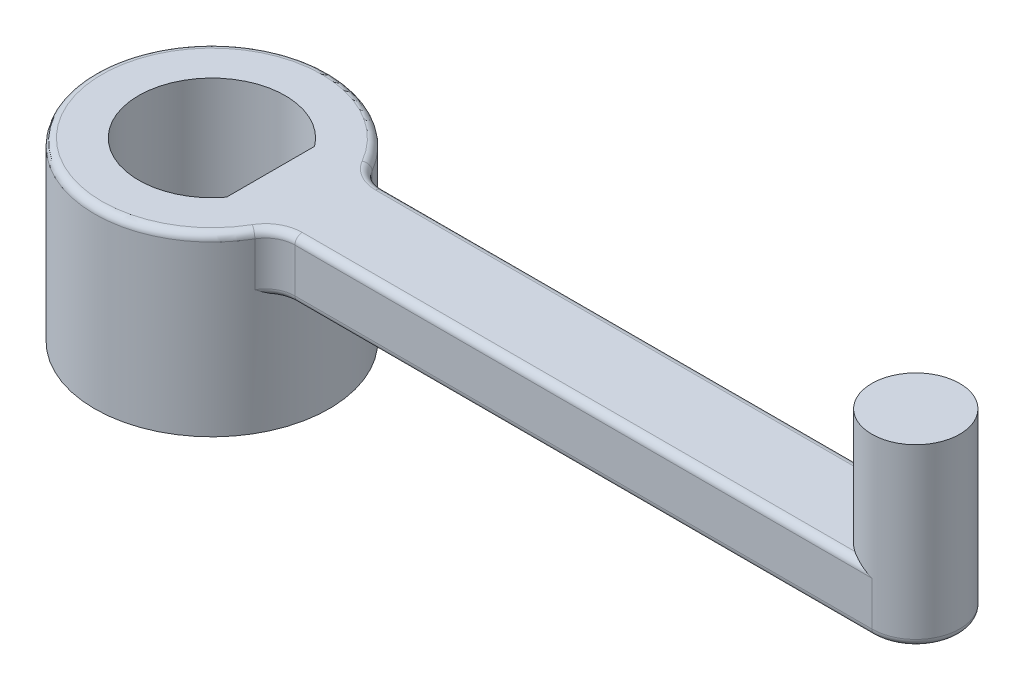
ISO-10303-21;
HEADER;
FILE_DESCRIPTION(('STEP AP214'),'2;1');
FILE_NAME('part.step','',(''),(''),'','','');
FILE_SCHEMA(('AUTOMOTIVE_DESIGN { 1 0 10303 214 1 1 1 1 }'));
ENDSEC;
DATA;
#1=APPLICATION_CONTEXT('core data for automotive mechanical design processes');
#2=APPLICATION_PROTOCOL_DEFINITION('international standard','automotive_design',2000,#1);
#3=PRODUCT_CONTEXT('',#1,'mechanical');
#4=PRODUCT('Part','Part','',(#3));
#5=PRODUCT_RELATED_PRODUCT_CATEGORY('part','',(#4));
#6=PRODUCT_DEFINITION_FORMATION('','',#4);
#7=PRODUCT_DEFINITION_CONTEXT('part definition',#1,'design');
#8=PRODUCT_DEFINITION('design','',#6,#7);
#9=PRODUCT_DEFINITION_SHAPE('','',#8);
#10=(LENGTH_UNIT() NAMED_UNIT(*) SI_UNIT(.MILLI.,.METRE.));
#11=(NAMED_UNIT(*) PLANE_ANGLE_UNIT() SI_UNIT($,.RADIAN.));
#12=(NAMED_UNIT(*) SI_UNIT($,.STERADIAN.) SOLID_ANGLE_UNIT());
#13=UNCERTAINTY_MEASURE_WITH_UNIT(LENGTH_MEASURE(1.E-05),#10,'distance_accuracy_value','');
#14=(GEOMETRIC_REPRESENTATION_CONTEXT(3) GLOBAL_UNCERTAINTY_ASSIGNED_CONTEXT((#13)) GLOBAL_UNIT_ASSIGNED_CONTEXT((#10,
#11,#12)) REPRESENTATION_CONTEXT('',''));
#15=CARTESIAN_POINT('',(0.,0.,0.));
#16=DIRECTION('',(0.,0.,1.));
#17=DIRECTION('',(1.,0.,0.));
#18=AXIS2_PLACEMENT_3D('',#15,#16,#17);
#19=CARTESIAN_POINT('',(0.,-19.05,0.));
#20=DIRECTION('',(0.,1.,0.));
#21=DIRECTION('',(0.,0.,1.));
#22=AXIS2_PLACEMENT_3D('',#19,#20,#21);
#23=CYLINDRICAL_SURFACE('',#22,7.9375);
#24=CARTESIAN_POINT('',(0.,0.,0.));
#25=DIRECTION('',(0.,1.,0.));
#26=DIRECTION('',(0.,0.,1.));
#27=AXIS2_PLACEMENT_3D('',#24,#25,#26);
#28=CIRCLE('',#27,7.9375);
#29=CARTESIAN_POINT('',(6.35,0.,-4.7625));
#30=VERTEX_POINT('',#29);
#31=CARTESIAN_POINT('',(6.35,0.,4.7625));
#32=VERTEX_POINT('',#31);
#33=EDGE_CURVE('E137',#30,#32,#28,.T.);
#34=ORIENTED_EDGE('',*,*,#33,.T.);
#35=DIRECTION('',(0.,1.,0.));
#36=VECTOR('',#35,1.);
#37=CARTESIAN_POINT('',(6.35,-19.05,4.7625));
#38=LINE('',#37,#36);
#39=CARTESIAN_POINT('',(6.35,-19.05,4.7625));
#40=VERTEX_POINT('',#39);
#41=EDGE_CURVE('E144',#40,#32,#38,.T.);
#42=ORIENTED_EDGE('',*,*,#41,.F.);
#43=CARTESIAN_POINT('',(0.,-19.05,0.));
#44=DIRECTION('',(0.,1.,0.));
#45=DIRECTION('',(0.,0.,1.));
#46=AXIS2_PLACEMENT_3D('',#43,#44,#45);
#47=CIRCLE('',#46,7.9375);
#48=CARTESIAN_POINT('',(6.35,-19.05,-4.7625));
#49=VERTEX_POINT('',#48);
#50=EDGE_CURVE('E139',#49,#40,#47,.T.);
#51=ORIENTED_EDGE('',*,*,#50,.F.);
#52=DIRECTION('',(0.,1.,0.));
#53=VECTOR('',#52,1.);
#54=CARTESIAN_POINT('',(6.35,-19.05,-4.7625));
#55=LINE('',#54,#53);
#56=EDGE_CURVE('E134',#49,#30,#55,.T.);
#57=ORIENTED_EDGE('',*,*,#56,.T.);
#58=EDGE_LOOP('',(#34,#42,#51,#57));
#59=FACE_BOUND('',#58,.T.);
#60=ADVANCED_FACE('F28',(#59),#23,.F.);
#61=CARTESIAN_POINT('',(0.,-19.05,0.));
#62=DIRECTION('',(0.,1.,0.));
#63=DIRECTION('',(0.,0.,1.));
#64=AXIS2_PLACEMENT_3D('',#61,#62,#63);
#65=CYLINDRICAL_SURFACE('',#64,12.7);
#66=DIRECTION('',(0.,1.,0.));
#67=VECTOR('',#66,1.);
#68=CARTESIAN_POINT('',(10.9985226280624,-19.05,6.35));
#69=LINE('',#68,#67);
#70=CARTESIAN_POINT('',(10.9985226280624,-5.55625,6.35));
#71=VERTEX_POINT('',#70);
#72=CARTESIAN_POINT('',(10.9985226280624,-0.793750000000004,6.35));
#73=VERTEX_POINT('',#72);
#74=EDGE_CURVE('E362',#71,#73,#69,.T.);
#75=ORIENTED_EDGE('',*,*,#74,.T.);
#76=CARTESIAN_POINT('',(0.,-0.79375,0.));
#77=DIRECTION('',(0.,1.,0.));
#78=DIRECTION('',(0.,0.,1.));
#79=AXIS2_PLACEMENT_3D('',#76,#77,#78);
#80=CIRCLE('',#79,12.7);
#81=CARTESIAN_POINT('',(10.9985226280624,-0.793750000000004,-6.35));
#82=VERTEX_POINT('',#81);
#83=EDGE_CURVE('E189',#73,#82,#80,.F.);
#84=ORIENTED_EDGE('',*,*,#83,.T.);
#85=DIRECTION('',(0.,1.,0.));
#86=VECTOR('',#85,1.);
#87=CARTESIAN_POINT('',(10.9985226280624,-19.05,-6.35));
#88=LINE('',#87,#86);
#89=CARTESIAN_POINT('',(10.9985226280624,-5.55625,-6.35));
#90=VERTEX_POINT('',#89);
#91=EDGE_CURVE('E378',#82,#90,#88,.F.);
#92=ORIENTED_EDGE('',*,*,#91,.T.);
#93=CARTESIAN_POINT('',(11.9050327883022,-6.35,-4.42269084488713));
#94=CARTESIAN_POINT('',(11.8845202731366,-6.34998223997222,-4.4779139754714));
#95=CARTESIAN_POINT('',(11.8636481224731,-6.34707340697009,-4.53291334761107));
#96=CARTESIAN_POINT('',(11.8213584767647,-6.33627705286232,-4.64207779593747));
#97=CARTESIAN_POINT('',(11.7999423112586,-6.32840072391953,-4.69624446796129));
#98=CARTESIAN_POINT('',(11.7355784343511,-6.29876588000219,-4.85584615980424));
#99=CARTESIAN_POINT('',(11.6919585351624,-6.27095694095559,-4.95987686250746));
#100=CARTESIAN_POINT('',(11.5973988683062,-6.19919389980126,-5.1774836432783));
#101=CARTESIAN_POINT('',(11.5462808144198,-6.15353928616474,-5.29039112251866));
#102=CARTESIAN_POINT('',(11.4425981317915,-6.05237475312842,-5.51106455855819));
#103=CARTESIAN_POINT('',(11.3900317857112,-5.99685266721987,-5.6188239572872));
#104=CARTESIAN_POINT('',(11.2829619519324,-5.87943881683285,-5.83086405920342));
#105=CARTESIAN_POINT('',(11.2284478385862,-5.81750683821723,-5.93511659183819));
#106=CARTESIAN_POINT('',(11.1173807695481,-5.69078167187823,-6.14064192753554));
#107=CARTESIAN_POINT('',(11.060828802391,-5.62598986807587,-6.24191613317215));
#108=CARTESIAN_POINT('',(11.0014544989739,-5.55952891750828,-6.34491980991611));
#109=CARTESIAN_POINT('',(10.9999890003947,-5.55788945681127,-6.34746015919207));
#110=CARTESIAN_POINT('',(10.9985226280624,-5.55625,-6.35));
#111=B_SPLINE_CURVE_WITH_KNOTS('',3,(#93,#94,#95,#96,#97,#98,#99,#100,#101,#102,#103,#104,#105,
#106,#107,#108,#109,#110),.UNSPECIFIED.,.F.,.F.,(4,2,2,2,2,2,2,2,4),(0.,0.176530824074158,
0.352665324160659,0.7002023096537,1.09578450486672,1.49185787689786,1.8905870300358,
2.28912530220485,2.2992049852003),.UNSPECIFIED.);
#112=CARTESIAN_POINT('',(11.9050327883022,-6.35,-4.42269084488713));
#113=VERTEX_POINT('',#112);
#114=EDGE_CURVE('E191',#90,#113,#111,.F.);
#115=ORIENTED_EDGE('',*,*,#114,.T.);
#116=CARTESIAN_POINT('',(0.,-6.35,0.));
#117=DIRECTION('',(0.,1.,0.));
#118=DIRECTION('',(0.,0.,1.));
#119=AXIS2_PLACEMENT_3D('',#116,#117,#118);
#120=CIRCLE('',#119,12.7);
#121=CARTESIAN_POINT('',(11.9050327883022,-6.35,4.42269084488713));
#122=VERTEX_POINT('',#121);
#123=EDGE_CURVE('E322',#122,#113,#120,.T.);
#124=ORIENTED_EDGE('',*,*,#123,.F.);
#125=CARTESIAN_POINT('',(11.9050327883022,-6.35,4.42269084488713));
#126=CARTESIAN_POINT('',(11.8845202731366,-6.34998223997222,4.4779139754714));
#127=CARTESIAN_POINT('',(11.8636481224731,-6.34707340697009,4.53291334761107));
#128=CARTESIAN_POINT('',(11.8213584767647,-6.33627705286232,4.64207779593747));
#129=CARTESIAN_POINT('',(11.7999423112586,-6.32840072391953,4.69624446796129));
#130=CARTESIAN_POINT('',(11.7355784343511,-6.29876588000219,4.85584615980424));
#131=CARTESIAN_POINT('',(11.6919585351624,-6.27095694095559,4.95987686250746));
#132=CARTESIAN_POINT('',(11.5973988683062,-6.19919389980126,5.1774836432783));
#133=CARTESIAN_POINT('',(11.5462808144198,-6.15353928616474,5.29039112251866));
#134=CARTESIAN_POINT('',(11.4425981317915,-6.05237475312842,5.51106455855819));
#135=CARTESIAN_POINT('',(11.3900317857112,-5.99685266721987,5.6188239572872));
#136=CARTESIAN_POINT('',(11.2829619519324,-5.87943881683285,5.83086405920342));
#137=CARTESIAN_POINT('',(11.2284478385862,-5.81750683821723,5.93511659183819));
#138=CARTESIAN_POINT('',(11.1173807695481,-5.69078167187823,6.14064192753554));
#139=CARTESIAN_POINT('',(11.060828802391,-5.62598986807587,6.24191613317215));
#140=CARTESIAN_POINT('',(11.0014544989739,-5.55952891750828,6.34491980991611));
#141=CARTESIAN_POINT('',(10.9999890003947,-5.55788945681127,6.34746015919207));
#142=CARTESIAN_POINT('',(10.9985226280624,-5.55625,6.35));
#143=B_SPLINE_CURVE_WITH_KNOTS('',3,(#125,#126,#127,#128,#129,#130,#131,#132,#133,#134,#135,
#136,#137,#138,#139,#140,#141,#142),.UNSPECIFIED.,.F.,.F.,(4,2,2,2,2,2,2,2,4),(0.,
0.176530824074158,0.352665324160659,0.7002023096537,1.09578450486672,1.49185787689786,
1.8905870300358,2.28912530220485,2.2992049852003),.UNSPECIFIED.);
#144=EDGE_CURVE('E197',#122,#71,#143,.T.);
#145=ORIENTED_EDGE('',*,*,#144,.T.);
#146=EDGE_LOOP('',(#75,#84,#92,#115,#124,#145));
#147=FACE_BOUND('',#146,.T.);
#148=CARTESIAN_POINT('',(0.,-19.05,0.));
#149=DIRECTION('',(0.,1.,0.));
#150=DIRECTION('',(0.,0.,1.));
#151=AXIS2_PLACEMENT_3D('',#148,#149,#150);
#152=CIRCLE('',#151,12.7);
#153=CARTESIAN_POINT('',(0.,-19.05,12.7));
#154=VERTEX_POINT('',#153);
#155=EDGE_CURVE('E153',#154,#154,#152,.T.);
#156=ORIENTED_EDGE('',*,*,#155,.T.);
#157=EDGE_LOOP('',(#156));
#158=FACE_BOUND('',#157,.T.);
#159=ADVANCED_FACE('F30',(#147,#158),#65,.T.);
#160=CARTESIAN_POINT('',(6.35,-19.05,0.));
#161=DIRECTION('',(-1.,0.,0.));
#162=DIRECTION('',(0.,0.,1.));
#163=AXIS2_PLACEMENT_3D('',#160,#161,#162);
#164=PLANE('',#163);
#165=DIRECTION('',(0.,0.,1.));
#166=VECTOR('',#165,1.);
#167=CARTESIAN_POINT('',(6.35,0.,0.));
#168=LINE('',#167,#166);
#169=EDGE_CURVE('E149',#30,#32,#168,.T.);
#170=ORIENTED_EDGE('',*,*,#169,.F.);
#171=ORIENTED_EDGE('',*,*,#56,.F.);
#172=DIRECTION('',(0.,0.,1.));
#173=VECTOR('',#172,1.);
#174=CARTESIAN_POINT('',(6.35,-19.05,0.));
#175=LINE('',#174,#173);
#176=EDGE_CURVE('E145',#49,#40,#175,.T.);
#177=ORIENTED_EDGE('',*,*,#176,.T.);
#178=ORIENTED_EDGE('',*,*,#41,.T.);
#179=EDGE_LOOP('',(#170,#171,#177,#178));
#180=FACE_BOUND('',#179,.T.);
#181=ADVANCED_FACE('F152',(#180),#164,.T.);
#182=CARTESIAN_POINT('',(-41.4938349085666,-19.05,0.));
#183=DIRECTION('',(0.,1.,0.));
#184=DIRECTION('',(0.,0.,1.));
#185=AXIS2_PLACEMENT_3D('',#182,#183,#184);
#186=PLANE('',#185);
#187=ORIENTED_EDGE('',*,*,#155,.F.);
#188=EDGE_LOOP('',(#187));
#189=FACE_BOUND('',#188,.T.);
#190=ORIENTED_EDGE('',*,*,#50,.T.);
#191=ORIENTED_EDGE('',*,*,#176,.F.);
#192=EDGE_LOOP('',(#190,#191));
#193=FACE_BOUND('',#192,.T.);
#194=ADVANCED_FACE('F285',(#189,#193),#186,.F.);
#195=CARTESIAN_POINT('',(-41.4938349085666,0.,0.));
#196=DIRECTION('',(0.,1.,0.));
#197=DIRECTION('',(0.,0.,1.));
#198=AXIS2_PLACEMENT_3D('',#195,#196,#197);
#199=PLANE('',#198);
#200=CARTESIAN_POINT('',(76.2,0.,0.));
#201=DIRECTION('',(0.,1.,0.));
#202=DIRECTION('',(0.,0.,1.));
#203=AXIS2_PLACEMENT_3D('',#200,#201,#202);
#204=CIRCLE('',#203,4.7625);
#205=CARTESIAN_POINT('',(73.5674290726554,0.,-3.96875));
#206=VERTEX_POINT('',#205);
#207=CARTESIAN_POINT('',(73.5674290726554,0.,3.96875));
#208=VERTEX_POINT('',#207);
#209=EDGE_CURVE('E161',#206,#208,#204,.T.);
#210=ORIENTED_EDGE('',*,*,#209,.F.);
#211=DIRECTION('',(1.,0.,0.));
#212=VECTOR('',#211,1.);
#213=CARTESIAN_POINT('',(13.748153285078,0.,-3.96875));
#214=LINE('',#213,#212);
#215=CARTESIAN_POINT('',(13.748153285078,0.,-3.96875));
#216=VERTEX_POINT('',#215);
#217=EDGE_CURVE('E49',#206,#216,#214,.F.);
#218=ORIENTED_EDGE('',*,*,#217,.T.);
#219=CARTESIAN_POINT('',(13.748153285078,0.,-7.9375));
#220=DIRECTION('',(0.,1.,0.));
#221=DIRECTION('',(0.,0.,1.));
#222=AXIS2_PLACEMENT_3D('',#219,#220,#221);
#223=CIRCLE('',#222,3.96875);
#224=CARTESIAN_POINT('',(10.3111149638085,0.,-5.953125));
#225=VERTEX_POINT('',#224);
#226=EDGE_CURVE('E186',#216,#225,#223,.F.);
#227=ORIENTED_EDGE('',*,*,#226,.T.);
#228=CARTESIAN_POINT('',(0.,0.,0.));
#229=DIRECTION('',(0.,1.,0.));
#230=DIRECTION('',(0.,0.,1.));
#231=AXIS2_PLACEMENT_3D('',#228,#229,#230);
#232=CIRCLE('',#231,11.90625);
#233=CARTESIAN_POINT('',(10.3111149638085,0.,5.953125));
#234=VERTEX_POINT('',#233);
#235=EDGE_CURVE('E181',#225,#234,#232,.T.);
#236=ORIENTED_EDGE('',*,*,#235,.T.);
#237=CARTESIAN_POINT('',(13.748153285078,0.,7.9375));
#238=DIRECTION('',(0.,1.,0.));
#239=DIRECTION('',(0.,0.,1.));
#240=AXIS2_PLACEMENT_3D('',#237,#238,#239);
#241=CIRCLE('',#240,3.96875);
#242=CARTESIAN_POINT('',(13.748153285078,0.,3.96875));
#243=VERTEX_POINT('',#242);
#244=EDGE_CURVE('E56',#234,#243,#241,.F.);
#245=ORIENTED_EDGE('',*,*,#244,.T.);
#246=DIRECTION('',(1.,0.,0.));
#247=VECTOR('',#246,1.);
#248=CARTESIAN_POINT('',(-41.4938349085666,0.,3.96875));
#249=LINE('',#248,#247);
#250=EDGE_CURVE('E184',#243,#208,#249,.T.);
#251=ORIENTED_EDGE('',*,*,#250,.T.);
#252=EDGE_LOOP('',(#210,#218,#227,#236,#245,#251));
#253=FACE_BOUND('',#252,.T.);
#254=ORIENTED_EDGE('',*,*,#33,.F.);
#255=ORIENTED_EDGE('',*,*,#169,.T.);
#256=EDGE_LOOP('',(#254,#255));
#257=FACE_BOUND('',#256,.T.);
#258=ADVANCED_FACE('F148',(#253,#257),#199,.T.);
#259=CARTESIAN_POINT('',(-41.4938349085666,-6.35,4.7625));
#260=DIRECTION('',(0.,0.,1.));
#261=DIRECTION('',(1.,0.,0.));
#262=AXIS2_PLACEMENT_3D('',#259,#260,#261);
#263=PLANE('',#262);
#264=DIRECTION('',(0.,-1.,0.));
#265=VECTOR('',#264,1.);
#266=CARTESIAN_POINT('',(13.748153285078,-6.35,4.7625));
#267=LINE('',#266,#265);
#268=CARTESIAN_POINT('',(13.748153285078,-0.793750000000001,4.7625));
#269=VERTEX_POINT('',#268);
#270=CARTESIAN_POINT('',(13.748153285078,-5.55625,4.7625));
#271=VERTEX_POINT('',#270);
#272=EDGE_CURVE('E341',#269,#271,#267,.T.);
#273=ORIENTED_EDGE('',*,*,#272,.T.);
#274=DIRECTION('',(1.,0.,0.));
#275=VECTOR('',#274,1.);
#276=CARTESIAN_POINT('',(76.2,-5.55625,4.7625));
#277=LINE('',#276,#275);
#278=CARTESIAN_POINT('',(76.2,-5.55625,4.7625));
#279=VERTEX_POINT('',#278);
#280=EDGE_CURVE('E176',#271,#279,#277,.T.);
#281=ORIENTED_EDGE('',*,*,#280,.T.);
#282=DIRECTION('',(0.,1.,0.));
#283=VECTOR('',#282,1.);
#284=CARTESIAN_POINT('',(76.2,-6.35,4.7625));
#285=LINE('',#284,#283);
#286=CARTESIAN_POINT('',(76.2,-0.79375,4.7625));
#287=VERTEX_POINT('',#286);
#288=EDGE_CURVE('E324',#279,#287,#285,.T.);
#289=ORIENTED_EDGE('',*,*,#288,.T.);
#290=DIRECTION('',(1.,0.,0.));
#291=VECTOR('',#290,1.);
#292=CARTESIAN_POINT('',(-41.4938349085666,-0.79375,4.7625));
#293=LINE('',#292,#291);
#294=EDGE_CURVE('E337',#287,#269,#293,.F.);
#295=ORIENTED_EDGE('',*,*,#294,.T.);
#296=EDGE_LOOP('',(#273,#281,#289,#295));
#297=FACE_BOUND('',#296,.T.);
#298=ADVANCED_FACE('F245',(#297),#263,.T.);
#299=CARTESIAN_POINT('',(-41.4938349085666,-6.35,-4.7625));
#300=DIRECTION('',(0.,0.,1.));
#301=DIRECTION('',(1.,0.,0.));
#302=AXIS2_PLACEMENT_3D('',#299,#300,#301);
#303=PLANE('',#302);
#304=DIRECTION('',(0.,1.,0.));
#305=VECTOR('',#304,1.);
#306=CARTESIAN_POINT('',(13.748153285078,-6.35,-4.7625));
#307=LINE('',#306,#305);
#308=CARTESIAN_POINT('',(13.748153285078,-5.55625,-4.7625));
#309=VERTEX_POINT('',#308);
#310=CARTESIAN_POINT('',(13.748153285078,-0.793750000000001,-4.7625));
#311=VERTEX_POINT('',#310);
#312=EDGE_CURVE('E171',#309,#311,#307,.T.);
#313=ORIENTED_EDGE('',*,*,#312,.T.);
#314=DIRECTION('',(1.,0.,0.));
#315=VECTOR('',#314,1.);
#316=CARTESIAN_POINT('',(76.2,-0.79375,-4.7625));
#317=LINE('',#316,#315);
#318=CARTESIAN_POINT('',(76.2,-0.79375,-4.7625));
#319=VERTEX_POINT('',#318);
#320=EDGE_CURVE('E178',#311,#319,#317,.T.);
#321=ORIENTED_EDGE('',*,*,#320,.T.);
#322=DIRECTION('',(0.,1.,0.));
#323=VECTOR('',#322,1.);
#324=CARTESIAN_POINT('',(76.2,-6.35,-4.7625));
#325=LINE('',#324,#323);
#326=CARTESIAN_POINT('',(76.2,-5.55625,-4.7625));
#327=VERTEX_POINT('',#326);
#328=EDGE_CURVE('E150',#327,#319,#325,.T.);
#329=ORIENTED_EDGE('',*,*,#328,.F.);
#330=DIRECTION('',(1.,0.,0.));
#331=VECTOR('',#330,1.);
#332=CARTESIAN_POINT('',(-41.4938349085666,-5.55625,-4.7625));
#333=LINE('',#332,#331);
#334=EDGE_CURVE('E175',#327,#309,#333,.F.);
#335=ORIENTED_EDGE('',*,*,#334,.T.);
#336=EDGE_LOOP('',(#313,#321,#329,#335));
#337=FACE_BOUND('',#336,.T.);
#338=ADVANCED_FACE('F243',(#337),#303,.F.);
#339=CARTESIAN_POINT('',(76.2,-6.35,0.));
#340=DIRECTION('',(0.,1.,0.));
#341=DIRECTION('',(0.,0.,1.));
#342=AXIS2_PLACEMENT_3D('',#339,#340,#341);
#343=CYLINDRICAL_SURFACE('',#342,4.7625);
#344=ORIENTED_EDGE('',*,*,#288,.F.);
#345=CARTESIAN_POINT('',(76.2,-5.55625,0.));
#346=DIRECTION('',(0.,1.,0.));
#347=DIRECTION('',(0.,0.,1.));
#348=AXIS2_PLACEMENT_3D('',#345,#346,#347);
#349=CIRCLE('',#348,4.7625);
#350=EDGE_CURVE('E173',#279,#327,#349,.T.);
#351=ORIENTED_EDGE('',*,*,#350,.T.);
#352=ORIENTED_EDGE('',*,*,#328,.T.);
#353=CARTESIAN_POINT('',(73.5674290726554,0.,-3.96875));
#354=CARTESIAN_POINT('',(73.6235754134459,-3.10465836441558E-05,-4.00600125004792));
#355=CARTESIAN_POINT('',(73.6804701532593,-0.00261926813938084,-4.04201744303));
#356=CARTESIAN_POINT('',(73.795379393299,-0.0121341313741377,-4.11140928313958));
#357=CARTESIAN_POINT('',(73.8533919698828,-0.0190538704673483,-4.14478903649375));
#358=CARTESIAN_POINT('',(73.9700320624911,-0.0364149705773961,-4.20868793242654));
#359=CARTESIAN_POINT('',(74.0286547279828,-0.0468375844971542,-4.23922122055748));
#360=CARTESIAN_POINT('',(74.1466544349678,-0.0706455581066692,-4.29761732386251));
#361=CARTESIAN_POINT('',(74.2060318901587,-0.0840326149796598,-4.32547859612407));
#362=CARTESIAN_POINT('',(74.3735320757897,-0.125075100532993,-4.3999248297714));
#363=CARTESIAN_POINT('',(74.4823320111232,-0.155528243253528,-4.44348035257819));
#364=CARTESIAN_POINT('',(74.7012056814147,-0.22226327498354,-4.52200877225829));
#365=CARTESIAN_POINT('',(74.8112800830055,-0.258548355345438,-4.55697694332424));
#366=CARTESIAN_POINT('',(75.143498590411,-0.373842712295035,-4.64953226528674));
#367=CARTESIAN_POINT('',(75.3671121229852,-0.459145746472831,-4.69454030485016));
#368=CARTESIAN_POINT('',(75.6904039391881,-0.587020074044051,-4.73621611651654));
#369=CARTESIAN_POINT('',(75.7897673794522,-0.626939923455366,-4.74584613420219));
#370=CARTESIAN_POINT('',(75.9885036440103,-0.70741853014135,-4.75884103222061));
#371=CARTESIAN_POINT('',(76.0878761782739,-0.747976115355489,-4.76221629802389));
#372=CARTESIAN_POINT('',(76.1914811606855,-0.790272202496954,-4.76249428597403));
#373=CARTESIAN_POINT('',(76.1957406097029,-0.792011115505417,-4.76250000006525));
#374=CARTESIAN_POINT('',(76.2,-0.79375,-4.7625));
#375=B_SPLINE_CURVE_WITH_KNOTS('',3,(#353,#354,#355,#356,#357,#358,#359,#360,#361,#362,#363,
#364,#365,#366,#367,#368,#369,#370,#371,#372,#373,#374),.UNSPECIFIED.,.F.,.F.,(4,2,2,2,2,2,2,2,
2,2,4),(0.,0.201992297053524,0.403663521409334,0.60427216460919,0.804995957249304,
1.16766430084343,1.53053178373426,2.25802367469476,2.58047176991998,2.90238398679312,
2.91618617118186),.UNSPECIFIED.);
#376=EDGE_CURVE('E42',#319,#206,#375,.F.);
#377=ORIENTED_EDGE('',*,*,#376,.T.);
#378=ORIENTED_EDGE('',*,*,#209,.T.);
#379=CARTESIAN_POINT('',(73.5674290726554,0.,3.96875));
#380=CARTESIAN_POINT('',(73.6235754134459,-3.1046583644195E-05,4.00600125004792));
#381=CARTESIAN_POINT('',(73.6804701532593,-0.00261926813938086,4.04201744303));
#382=CARTESIAN_POINT('',(73.795379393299,-0.0121341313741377,4.11140928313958));
#383=CARTESIAN_POINT('',(73.8533919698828,-0.0190538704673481,4.14478903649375));
#384=CARTESIAN_POINT('',(73.9700320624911,-0.0364149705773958,4.20868793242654));
#385=CARTESIAN_POINT('',(74.0286547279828,-0.0468375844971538,4.23922122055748));
#386=CARTESIAN_POINT('',(74.1466544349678,-0.0706455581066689,4.29761732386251));
#387=CARTESIAN_POINT('',(74.2060318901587,-0.0840326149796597,4.32547859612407));
#388=CARTESIAN_POINT('',(74.3735320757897,-0.125075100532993,4.3999248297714));
#389=CARTESIAN_POINT('',(74.4823320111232,-0.155528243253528,4.44348035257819));
#390=CARTESIAN_POINT('',(74.7012056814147,-0.22226327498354,4.52200877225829));
#391=CARTESIAN_POINT('',(74.8112800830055,-0.258548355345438,4.55697694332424));
#392=CARTESIAN_POINT('',(75.143498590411,-0.373842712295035,4.64953226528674));
#393=CARTESIAN_POINT('',(75.3671121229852,-0.459145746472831,4.69454030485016));
#394=CARTESIAN_POINT('',(75.6904039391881,-0.587020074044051,4.73621611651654));
#395=CARTESIAN_POINT('',(75.7897673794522,-0.626939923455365,4.74584613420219));
#396=CARTESIAN_POINT('',(75.9885036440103,-0.707418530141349,4.75884103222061));
#397=CARTESIAN_POINT('',(76.0878761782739,-0.747976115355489,4.76221629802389));
#398=CARTESIAN_POINT('',(76.1914811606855,-0.790272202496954,4.76249428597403));
#399=CARTESIAN_POINT('',(76.1957406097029,-0.792011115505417,4.76250000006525));
#400=CARTESIAN_POINT('',(76.2,-0.79375,4.7625));
#401=B_SPLINE_CURVE_WITH_KNOTS('',3,(#379,#380,#381,#382,#383,#384,#385,#386,#387,#388,#389,
#390,#391,#392,#393,#394,#395,#396,#397,#398,#399,#400),.UNSPECIFIED.,.F.,.F.,(4,2,2,2,2,2,2,2,
2,2,4),(0.,0.201992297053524,0.403663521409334,0.60427216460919,0.804995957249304,
1.16766430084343,1.53053178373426,2.25802367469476,2.58047176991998,2.90238398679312,
2.91618617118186),.UNSPECIFIED.);
#402=EDGE_CURVE('E11',#208,#287,#401,.T.);
#403=ORIENTED_EDGE('',*,*,#402,.T.);
#404=EDGE_LOOP('',(#344,#351,#352,#377,#378,#403));
#405=FACE_BOUND('',#404,.T.);
#406=CARTESIAN_POINT('',(76.2,12.7,0.));
#407=DIRECTION('',(0.,1.,0.));
#408=DIRECTION('',(0.,0.,1.));
#409=AXIS2_PLACEMENT_3D('',#406,#407,#408);
#410=CIRCLE('',#409,4.7625);
#411=CARTESIAN_POINT('',(76.2,12.7,4.7625));
#412=VERTEX_POINT('',#411);
#413=EDGE_CURVE('E320',#412,#412,#410,.T.);
#414=ORIENTED_EDGE('',*,*,#413,.F.);
#415=EDGE_LOOP('',(#414));
#416=FACE_BOUND('',#415,.T.);
#417=ADVANCED_FACE('F241',(#405,#416),#343,.T.);
#418=CARTESIAN_POINT('',(-41.4938349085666,-6.35,0.));
#419=DIRECTION('',(0.,1.,0.));
#420=DIRECTION('',(0.,0.,1.));
#421=AXIS2_PLACEMENT_3D('',#418,#419,#420);
#422=PLANE('',#421);
#423=ORIENTED_EDGE('',*,*,#123,.T.);
#424=CARTESIAN_POINT('',(13.748153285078,-6.35,-7.9375));
#425=DIRECTION('',(0.,1.,0.));
#426=DIRECTION('',(0.,0.,1.));
#427=AXIS2_PLACEMENT_3D('',#424,#425,#426);
#428=CIRCLE('',#427,3.96875);
#429=CARTESIAN_POINT('',(13.748153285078,-6.35,-3.96875));
#430=VERTEX_POINT('',#429);
#431=EDGE_CURVE('E367',#113,#430,#428,.T.);
#432=ORIENTED_EDGE('',*,*,#431,.T.);
#433=DIRECTION('',(1.,0.,0.));
#434=VECTOR('',#433,1.);
#435=CARTESIAN_POINT('',(-41.4938349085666,-6.35,-3.96875));
#436=LINE('',#435,#434);
#437=CARTESIAN_POINT('',(76.2,-6.35,-3.96875));
#438=VERTEX_POINT('',#437);
#439=EDGE_CURVE('E375',#430,#438,#436,.T.);
#440=ORIENTED_EDGE('',*,*,#439,.T.);
#441=CARTESIAN_POINT('',(76.2,-6.35,0.));
#442=DIRECTION('',(0.,1.,0.));
#443=DIRECTION('',(0.,0.,1.));
#444=AXIS2_PLACEMENT_3D('',#441,#442,#443);
#445=CIRCLE('',#444,3.96875);
#446=CARTESIAN_POINT('',(76.2,-6.35,3.96875));
#447=VERTEX_POINT('',#446);
#448=EDGE_CURVE('E352',#438,#447,#445,.F.);
#449=ORIENTED_EDGE('',*,*,#448,.T.);
#450=DIRECTION('',(1.,0.,0.));
#451=VECTOR('',#450,1.);
#452=CARTESIAN_POINT('',(13.748153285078,-6.35,3.96875));
#453=LINE('',#452,#451);
#454=CARTESIAN_POINT('',(13.748153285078,-6.35,3.96875));
#455=VERTEX_POINT('',#454);
#456=EDGE_CURVE('E348',#447,#455,#453,.F.);
#457=ORIENTED_EDGE('',*,*,#456,.T.);
#458=CARTESIAN_POINT('',(13.748153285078,-6.35,7.9375));
#459=DIRECTION('',(0.,1.,0.));
#460=DIRECTION('',(0.,0.,1.));
#461=AXIS2_PLACEMENT_3D('',#458,#459,#460);
#462=CIRCLE('',#461,3.96875);
#463=EDGE_CURVE('E371',#455,#122,#462,.T.);
#464=ORIENTED_EDGE('',*,*,#463,.T.);
#465=EDGE_LOOP('',(#423,#432,#440,#449,#457,#464));
#466=FACE_BOUND('',#465,.T.);
#467=ADVANCED_FACE('F237',(#466),#422,.F.);
#468=CARTESIAN_POINT('',(-41.4938349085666,12.7,0.));
#469=DIRECTION('',(0.,1.,0.));
#470=DIRECTION('',(0.,0.,1.));
#471=AXIS2_PLACEMENT_3D('',#468,#469,#470);
#472=PLANE('',#471);
#473=ORIENTED_EDGE('',*,*,#413,.T.);
#474=EDGE_LOOP('',(#473));
#475=FACE_BOUND('',#474,.T.);
#476=ADVANCED_FACE('F233',(#475),#472,.T.);
#477=CARTESIAN_POINT('',(13.748153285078,-19.05,-7.9375));
#478=DIRECTION('',(0.,1.,0.));
#479=DIRECTION('',(0.,0.,1.));
#480=AXIS2_PLACEMENT_3D('',#477,#478,#479);
#481=CYLINDRICAL_SURFACE('',#480,3.175);
#482=ORIENTED_EDGE('',*,*,#312,.F.);
#483=CARTESIAN_POINT('',(13.748153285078,-5.55625,-7.9375));
#484=DIRECTION('',(0.,1.,0.));
#485=DIRECTION('',(0.,0.,1.));
#486=AXIS2_PLACEMENT_3D('',#483,#484,#485);
#487=CIRCLE('',#486,3.175);
#488=EDGE_CURVE('E359',#309,#90,#487,.F.);
#489=ORIENTED_EDGE('',*,*,#488,.T.);
#490=ORIENTED_EDGE('',*,*,#91,.F.);
#491=CARTESIAN_POINT('',(13.748153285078,-0.793750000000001,-7.9375));
#492=DIRECTION('',(0.,1.,0.));
#493=DIRECTION('',(0.,0.,1.));
#494=AXIS2_PLACEMENT_3D('',#491,#492,#493);
#495=CIRCLE('',#494,3.175);
#496=EDGE_CURVE('E361',#82,#311,#495,.T.);
#497=ORIENTED_EDGE('',*,*,#496,.T.);
#498=EDGE_LOOP('',(#482,#489,#490,#497));
#499=FACE_BOUND('',#498,.T.);
#500=ADVANCED_FACE('F229',(#499),#481,.F.);
#501=CARTESIAN_POINT('',(13.748153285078,-19.05,7.9375));
#502=DIRECTION('',(0.,1.,0.));
#503=DIRECTION('',(0.,0.,1.));
#504=AXIS2_PLACEMENT_3D('',#501,#502,#503);
#505=CYLINDRICAL_SURFACE('',#504,3.175);
#506=ORIENTED_EDGE('',*,*,#74,.F.);
#507=CARTESIAN_POINT('',(13.748153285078,-5.55625,7.9375));
#508=DIRECTION('',(0.,1.,0.));
#509=DIRECTION('',(0.,0.,1.));
#510=AXIS2_PLACEMENT_3D('',#507,#508,#509);
#511=CIRCLE('',#510,3.175);
#512=EDGE_CURVE('E335',#71,#271,#511,.F.);
#513=ORIENTED_EDGE('',*,*,#512,.T.);
#514=ORIENTED_EDGE('',*,*,#272,.F.);
#515=CARTESIAN_POINT('',(13.748153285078,-0.793750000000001,7.9375));
#516=DIRECTION('',(0.,1.,0.));
#517=DIRECTION('',(0.,0.,1.));
#518=AXIS2_PLACEMENT_3D('',#515,#516,#517);
#519=CIRCLE('',#518,3.175);
#520=EDGE_CURVE('E365',#269,#73,#519,.T.);
#521=ORIENTED_EDGE('',*,*,#520,.T.);
#522=EDGE_LOOP('',(#506,#513,#514,#521));
#523=FACE_BOUND('',#522,.T.);
#524=ADVANCED_FACE('F225',(#523),#505,.F.);
#525=CARTESIAN_POINT('',(13.748153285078,-5.55625,7.9375));
#526=DIRECTION('',(0.,1.,0.));
#527=DIRECTION('',(0.,0.,1.));
#528=AXIS2_PLACEMENT_3D('',#525,#526,#527);
#529=TOROIDAL_SURFACE('',#528,3.96875,0.79375);
#530=ORIENTED_EDGE('',*,*,#144,.F.);
#531=ORIENTED_EDGE('',*,*,#463,.F.);
#532=CARTESIAN_POINT('',(13.748153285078,-5.55625,3.96875));
#533=DIRECTION('',(1.,0.,0.));
#534=DIRECTION('',(0.,0.,-1.));
#535=AXIS2_PLACEMENT_3D('',#532,#533,#534);
#536=CIRCLE('',#535,0.79375);
#537=EDGE_CURVE('E317',#271,#455,#536,.T.);
#538=ORIENTED_EDGE('',*,*,#537,.F.);
#539=ORIENTED_EDGE('',*,*,#512,.F.);
#540=EDGE_LOOP('',(#530,#531,#538,#539));
#541=FACE_BOUND('',#540,.T.);
#542=ADVANCED_FACE('F220',(#541),#529,.T.);
#543=CARTESIAN_POINT('',(-41.4938349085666,-5.55625,3.96875));
#544=DIRECTION('',(-1.,0.,0.));
#545=DIRECTION('',(0.,0.,1.));
#546=AXIS2_PLACEMENT_3D('',#543,#544,#545);
#547=CYLINDRICAL_SURFACE('',#546,0.79375);
#548=ORIENTED_EDGE('',*,*,#537,.T.);
#549=ORIENTED_EDGE('',*,*,#456,.F.);
#550=CARTESIAN_POINT('',(76.2,-5.55625,3.96875));
#551=DIRECTION('',(1.,0.,0.));
#552=DIRECTION('',(0.,0.,-1.));
#553=AXIS2_PLACEMENT_3D('',#550,#551,#552);
#554=CIRCLE('',#553,0.79375);
#555=EDGE_CURVE('E314',#279,#447,#554,.T.);
#556=ORIENTED_EDGE('',*,*,#555,.F.);
#557=ORIENTED_EDGE('',*,*,#280,.F.);
#558=EDGE_LOOP('',(#548,#549,#556,#557));
#559=FACE_BOUND('',#558,.T.);
#560=ADVANCED_FACE('F217',(#559),#547,.T.);
#561=CARTESIAN_POINT('',(76.2,-5.55625,0.));
#562=DIRECTION('',(0.,1.,0.));
#563=DIRECTION('',(0.,0.,1.));
#564=AXIS2_PLACEMENT_3D('',#561,#562,#563);
#565=TOROIDAL_SURFACE('',#564,3.96875,0.79375);
#566=ORIENTED_EDGE('',*,*,#555,.T.);
#567=ORIENTED_EDGE('',*,*,#448,.F.);
#568=CARTESIAN_POINT('',(76.2,-5.55625,-3.96875));
#569=DIRECTION('',(-1.,0.,0.));
#570=DIRECTION('',(0.,0.,1.));
#571=AXIS2_PLACEMENT_3D('',#568,#569,#570);
#572=CIRCLE('',#571,0.79375);
#573=EDGE_CURVE('E311',#327,#438,#572,.T.);
#574=ORIENTED_EDGE('',*,*,#573,.F.);
#575=ORIENTED_EDGE('',*,*,#350,.F.);
#576=EDGE_LOOP('',(#566,#567,#574,#575));
#577=FACE_BOUND('',#576,.T.);
#578=ADVANCED_FACE('F213',(#577),#565,.T.);
#579=CARTESIAN_POINT('',(-41.4938349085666,-5.55625,-3.96875));
#580=DIRECTION('',(1.,0.,0.));
#581=DIRECTION('',(0.,0.,-1.));
#582=AXIS2_PLACEMENT_3D('',#579,#580,#581);
#583=CYLINDRICAL_SURFACE('',#582,0.79375);
#584=ORIENTED_EDGE('',*,*,#573,.T.);
#585=ORIENTED_EDGE('',*,*,#439,.F.);
#586=CARTESIAN_POINT('',(13.748153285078,-5.55625,-3.96875));
#587=DIRECTION('',(-1.,0.,0.));
#588=DIRECTION('',(0.,0.,1.));
#589=AXIS2_PLACEMENT_3D('',#586,#587,#588);
#590=CIRCLE('',#589,0.79375);
#591=EDGE_CURVE('E309',#309,#430,#590,.T.);
#592=ORIENTED_EDGE('',*,*,#591,.F.);
#593=ORIENTED_EDGE('',*,*,#334,.F.);
#594=EDGE_LOOP('',(#584,#585,#592,#593));
#595=FACE_BOUND('',#594,.T.);
#596=ADVANCED_FACE('F207',(#595),#583,.T.);
#597=CARTESIAN_POINT('',(13.748153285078,-5.55625,-7.9375));
#598=DIRECTION('',(0.,1.,0.));
#599=DIRECTION('',(0.,0.,1.));
#600=AXIS2_PLACEMENT_3D('',#597,#598,#599);
#601=TOROIDAL_SURFACE('',#600,3.96875,0.79375);
#602=ORIENTED_EDGE('',*,*,#114,.F.);
#603=ORIENTED_EDGE('',*,*,#488,.F.);
#604=ORIENTED_EDGE('',*,*,#591,.T.);
#605=ORIENTED_EDGE('',*,*,#431,.F.);
#606=EDGE_LOOP('',(#602,#603,#604,#605));
#607=FACE_BOUND('',#606,.T.);
#608=ADVANCED_FACE('F202',(#607),#601,.T.);
#609=CARTESIAN_POINT('',(-41.4938349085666,-0.79375,3.96875));
#610=DIRECTION('',(1.,0.,0.));
#611=DIRECTION('',(0.,0.,-1.));
#612=AXIS2_PLACEMENT_3D('',#609,#610,#611);
#613=CYLINDRICAL_SURFACE('',#612,0.79375);
#614=ORIENTED_EDGE('',*,*,#402,.F.);
#615=ORIENTED_EDGE('',*,*,#250,.F.);
#616=CARTESIAN_POINT('',(13.748153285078,-0.79375,3.96875));
#617=DIRECTION('',(-1.,0.,0.));
#618=DIRECTION('',(0.,0.,1.));
#619=AXIS2_PLACEMENT_3D('',#616,#617,#618);
#620=CIRCLE('',#619,0.79375);
#621=EDGE_CURVE('E307',#269,#243,#620,.T.);
#622=ORIENTED_EDGE('',*,*,#621,.F.);
#623=ORIENTED_EDGE('',*,*,#294,.F.);
#624=EDGE_LOOP('',(#614,#615,#622,#623));
#625=FACE_BOUND('',#624,.T.);
#626=ADVANCED_FACE('F206',(#625),#613,.T.);
#627=CARTESIAN_POINT('',(13.748153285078,-0.79375,7.9375));
#628=DIRECTION('',(0.,1.,0.));
#629=DIRECTION('',(0.,0.,1.));
#630=AXIS2_PLACEMENT_3D('',#627,#628,#629);
#631=TOROIDAL_SURFACE('',#630,3.96875,0.79375);
#632=ORIENTED_EDGE('',*,*,#621,.T.);
#633=ORIENTED_EDGE('',*,*,#244,.F.);
#634=CARTESIAN_POINT('',(10.3111149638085,-0.79375,5.953125));
#635=DIRECTION('',(-0.5,0.,0.866025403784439));
#636=DIRECTION('',(0.866025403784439,0.,0.5));
#637=AXIS2_PLACEMENT_3D('',#634,#635,#636);
#638=CIRCLE('',#637,0.79375);
#639=EDGE_CURVE('E302',#73,#234,#638,.T.);
#640=ORIENTED_EDGE('',*,*,#639,.F.);
#641=ORIENTED_EDGE('',*,*,#520,.F.);
#642=EDGE_LOOP('',(#632,#633,#640,#641));
#643=FACE_BOUND('',#642,.T.);
#644=ADVANCED_FACE('F268',(#643),#631,.T.);
#645=CARTESIAN_POINT('',(0.,-0.79375,0.));
#646=DIRECTION('',(0.,1.,0.));
#647=DIRECTION('',(0.,0.,1.));
#648=AXIS2_PLACEMENT_3D('',#645,#646,#647);
#649=TOROIDAL_SURFACE('',#648,11.90625,0.79375);
#650=ORIENTED_EDGE('',*,*,#639,.T.);
#651=ORIENTED_EDGE('',*,*,#235,.F.);
#652=CARTESIAN_POINT('',(10.3111149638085,-0.79375,-5.953125));
#653=DIRECTION('',(0.5,0.,0.866025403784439));
#654=DIRECTION('',(0.866025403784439,0.,-0.5));
#655=AXIS2_PLACEMENT_3D('',#652,#653,#654);
#656=CIRCLE('',#655,0.79375);
#657=EDGE_CURVE('E299',#82,#225,#656,.T.);
#658=ORIENTED_EDGE('',*,*,#657,.F.);
#659=ORIENTED_EDGE('',*,*,#83,.F.);
#660=EDGE_LOOP('',(#650,#651,#658,#659));
#661=FACE_BOUND('',#660,.T.);
#662=ADVANCED_FACE('F265',(#661),#649,.T.);
#663=CARTESIAN_POINT('',(13.748153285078,-0.79375,-7.9375));
#664=DIRECTION('',(0.,1.,0.));
#665=DIRECTION('',(0.,0.,1.));
#666=AXIS2_PLACEMENT_3D('',#663,#664,#665);
#667=TOROIDAL_SURFACE('',#666,3.96875,0.79375);
#668=ORIENTED_EDGE('',*,*,#657,.T.);
#669=ORIENTED_EDGE('',*,*,#226,.F.);
#670=CARTESIAN_POINT('',(13.748153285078,-0.79375,-3.96875));
#671=DIRECTION('',(1.,0.,0.));
#672=DIRECTION('',(0.,0.,-1.));
#673=AXIS2_PLACEMENT_3D('',#670,#671,#672);
#674=CIRCLE('',#673,0.79375);
#675=EDGE_CURVE('E297',#311,#216,#674,.T.);
#676=ORIENTED_EDGE('',*,*,#675,.F.);
#677=ORIENTED_EDGE('',*,*,#496,.F.);
#678=EDGE_LOOP('',(#668,#669,#676,#677));
#679=FACE_BOUND('',#678,.T.);
#680=ADVANCED_FACE('F261',(#679),#667,.T.);
#681=CARTESIAN_POINT('',(-41.4938349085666,-0.79375,-3.96875));
#682=DIRECTION('',(-1.,0.,0.));
#683=DIRECTION('',(0.,0.,1.));
#684=AXIS2_PLACEMENT_3D('',#681,#682,#683);
#685=CYLINDRICAL_SURFACE('',#684,0.79375);
#686=ORIENTED_EDGE('',*,*,#675,.T.);
#687=ORIENTED_EDGE('',*,*,#217,.F.);
#688=ORIENTED_EDGE('',*,*,#376,.F.);
#689=ORIENTED_EDGE('',*,*,#320,.F.);
#690=EDGE_LOOP('',(#686,#687,#688,#689));
#691=FACE_BOUND('',#690,.T.);
#692=ADVANCED_FACE('F257',(#691),#685,.T.);
#693=CLOSED_SHELL('',(#60,#159,#181,#194,#258,#298,#338,#417,#467,#476,#500,#524,#542,#560,#578,
#596,#608,#626,#644,#662,#680,#692));
#694=MANIFOLD_SOLID_BREP('B2',#693);
#695=ADVANCED_BREP_SHAPE_REPRESENTATION('',(#18,#694),#14);
#696=SHAPE_DEFINITION_REPRESENTATION(#9,#695);
ENDSEC;
END-ISO-10303-21;
